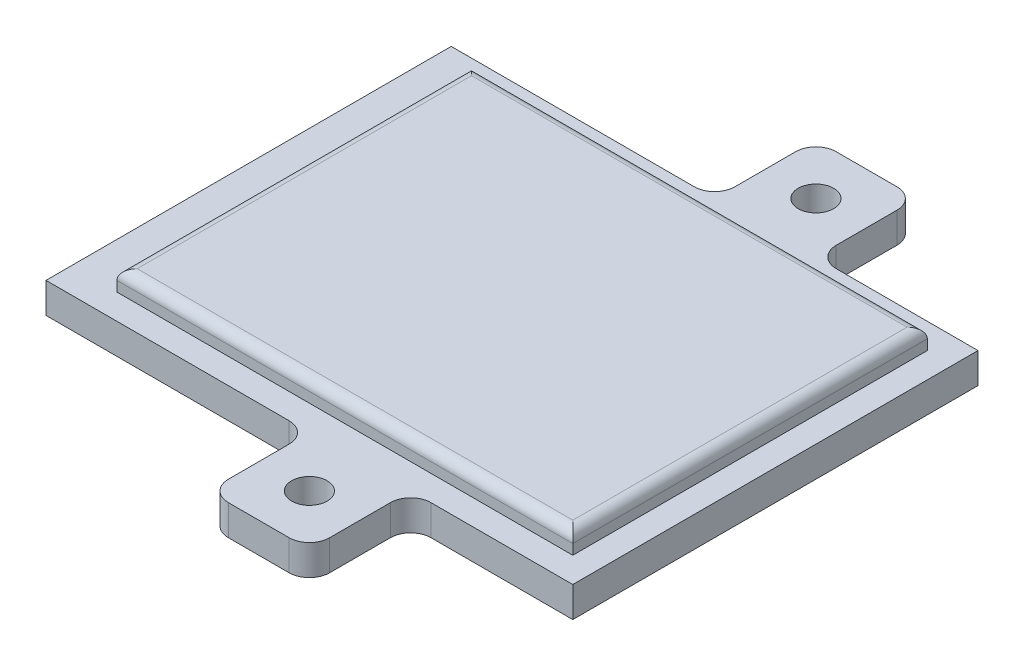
from build123d import *

# Parameters (mm, degrees)
SKETCH1_W           = 52
SKETCH1_H           = 40
SKETCH1_W_2         = 10
SKETCH1_H_2         = 10
BOSS_EXTRUDE1_DEPTH = 3
SKETCH2_W           = 45
SKETCH2_H           = 35
BOSS_EXTRUDE2_DEPTH = 2
FILLET1_R           = 1
SKETCH3_R           = 1.75
CUT_EXTRUDE1_DEPTH  = 73.201108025
FILLET2_R           = 2


with BuildPart() as part:
    # Sketch1 → Boss-Extrude1 (new body)
    with BuildSketch(Plane(origin=(0, 0, 0), x_dir=(1, 0, 0), z_dir=(0, 1, 0))):
        with Locations((-26, 20)):
            Rectangle(SKETCH1_W, SKETCH1_H)
        with Locations((-21, -5)):
            Rectangle(SKETCH1_W_2, SKETCH1_H_2)
        with Locations((-21, 45)):
            Rectangle(SKETCH1_W_2, SKETCH1_H_2)
    extrude(amount=BOSS_EXTRUDE1_DEPTH)

    # Sketch2 → Boss-Extrude2 (add)
    with BuildSketch(Plane(origin=(0, 3, 0), x_dir=(1, 0, 0), z_dir=(0, 1, 0))):
        with Locations((-25, 20)):
            Rectangle(SKETCH2_W, SKETCH2_H)
    extrude(amount=BOSS_EXTRUDE2_DEPTH)

    # Fillet1
    fillet1_edges = [part.edges().sort_by_distance(p)[0] for p in [
        (-2.5, 5, -20),
        (-25, 5, -37.5),
        (-47.5, 5, -20),
        (-25, 5, -2.5),
    ]]
    fillet(fillet1_edges, radius=FILLET1_R)

    # Sketch3 → Cut-Extrude1 (cut, through all)
    with BuildSketch(Plane(origin=(0, 3, 0), x_dir=(1, 0, 0), z_dir=(0, 1, 0))):
        with Locations(Location((-21, 45, 0), (0, 0, 270))):
            Circle(SKETCH3_R)
        with Locations(Location((-21, -5, 0), (0, 0, 270))):
            Circle(SKETCH3_R)
    extrude(amount=-CUT_EXTRUDE1_DEPTH, mode=Mode.SUBTRACT)

    # Fillet2
    fillet2_edges = [part.edges().sort_by_distance(p)[0] for p in [
        (-16, 1.5, 0),
        (-26, 1.5, 0),
        (-26, 1.5, -40),
        (-16, 1.5, -40),
        (-26, 1.5, -50),
        (-16, 1.5, -50),
        (-16, 1.5, 10),
        (-26, 1.5, 10),
    ]]
    fillet(fillet2_edges, radius=FILLET2_R)


solid = part.part
